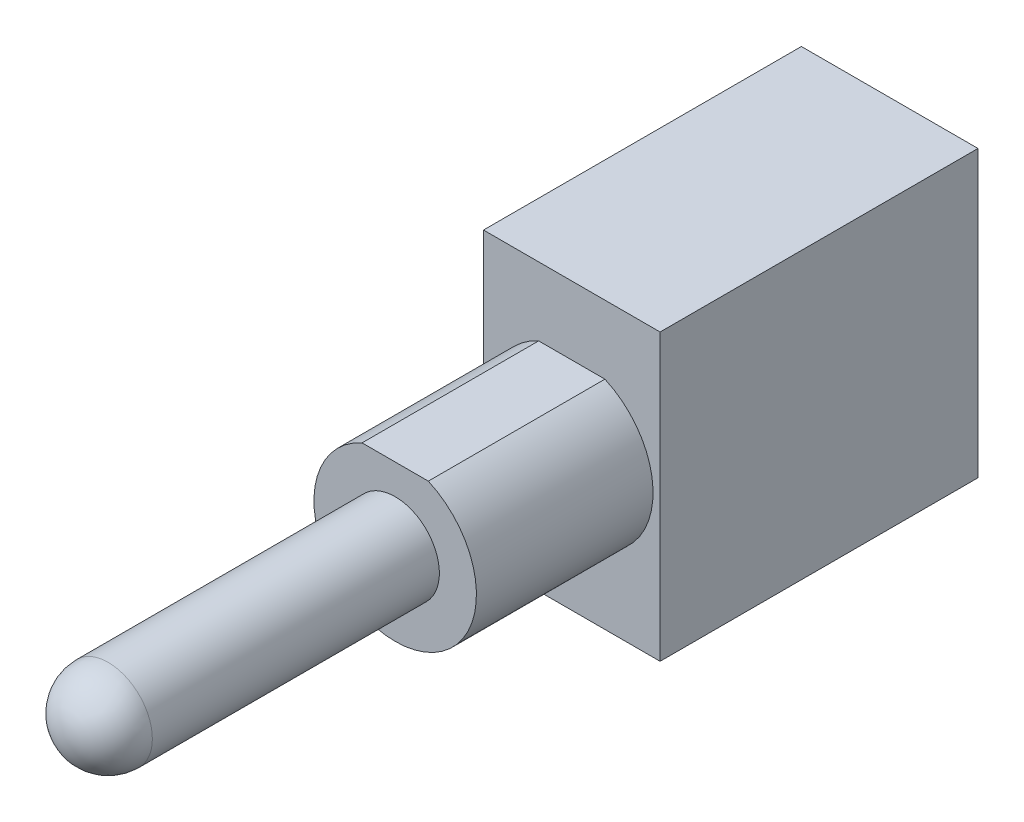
ISO-10303-21;
HEADER;
FILE_DESCRIPTION(('STEP AP214'),'2;1');
FILE_NAME('part.step','',(''),(''),'','','');
FILE_SCHEMA(('AUTOMOTIVE_DESIGN { 1 0 10303 214 1 1 1 1 }'));
ENDSEC;
DATA;
#1=APPLICATION_CONTEXT('core data for automotive mechanical design processes');
#2=APPLICATION_PROTOCOL_DEFINITION('international standard','automotive_design',2000,#1);
#3=PRODUCT_CONTEXT('',#1,'mechanical');
#4=PRODUCT('Part','Part','',(#3));
#5=PRODUCT_RELATED_PRODUCT_CATEGORY('part','',(#4));
#6=PRODUCT_DEFINITION_FORMATION('','',#4);
#7=PRODUCT_DEFINITION_CONTEXT('part definition',#1,'design');
#8=PRODUCT_DEFINITION('design','',#6,#7);
#9=PRODUCT_DEFINITION_SHAPE('','',#8);
#10=(LENGTH_UNIT() NAMED_UNIT(*) SI_UNIT(.MILLI.,.METRE.));
#11=(NAMED_UNIT(*) PLANE_ANGLE_UNIT() SI_UNIT($,.RADIAN.));
#12=(NAMED_UNIT(*) SI_UNIT($,.STERADIAN.) SOLID_ANGLE_UNIT());
#13=UNCERTAINTY_MEASURE_WITH_UNIT(LENGTH_MEASURE(1.E-05),#10,'distance_accuracy_value','');
#14=(GEOMETRIC_REPRESENTATION_CONTEXT(3) GLOBAL_UNCERTAINTY_ASSIGNED_CONTEXT((#13)) GLOBAL_UNIT_ASSIGNED_CONTEXT((#10,
#11,#12)) REPRESENTATION_CONTEXT('',''));
#15=CARTESIAN_POINT('',(0.,0.,0.));
#16=DIRECTION('',(0.,0.,1.));
#17=DIRECTION('',(1.,0.,0.));
#18=AXIS2_PLACEMENT_3D('',#15,#16,#17);
#19=CARTESIAN_POINT('',(5.08,4.1021,4.572));
#20=DIRECTION('',(0.,0.,-1.));
#21=DIRECTION('',(0.,1.,0.));
#22=AXIS2_PLACEMENT_3D('',#19,#20,#21);
#23=PLANE('',#22);
#24=DIRECTION('',(1.,0.,0.));
#25=VECTOR('',#24,1.);
#26=CARTESIAN_POINT('',(1.58690751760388,2.1336,4.572));
#27=LINE('',#26,#25);
#28=CARTESIAN_POINT('',(1.58690751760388,2.1336,4.572));
#29=VERTEX_POINT('',#28);
#30=CARTESIAN_POINT('',(3.49309248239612,2.1336,4.572));
#31=VERTEX_POINT('',#30);
#32=EDGE_CURVE('E94',#29,#31,#27,.T.);
#33=ORIENTED_EDGE('',*,*,#32,.T.);
#34=CARTESIAN_POINT('',(2.54,0.,4.572));
#35=DIRECTION('',(0.,0.,-1.));
#36=DIRECTION('',(0.,1.,0.));
#37=AXIS2_PLACEMENT_3D('',#34,#35,#36);
#38=CIRCLE('',#37,2.3368);
#39=EDGE_CURVE('E38',#29,#31,#38,.F.);
#40=ORIENTED_EDGE('',*,*,#39,.F.);
#41=EDGE_LOOP('',(#33,#40));
#42=FACE_BOUND('',#41,.T.);
#43=DIRECTION('',(0.,-1.,0.));
#44=VECTOR('',#43,1.);
#45=CARTESIAN_POINT('',(0.,4.1021,4.572));
#46=LINE('',#45,#44);
#47=CARTESIAN_POINT('',(0.,4.1021,4.572));
#48=VERTEX_POINT('',#47);
#49=CARTESIAN_POINT('',(0.,-4.1021,4.572));
#50=VERTEX_POINT('',#49);
#51=EDGE_CURVE('E122',#48,#50,#46,.T.);
#52=ORIENTED_EDGE('',*,*,#51,.T.);
#53=DIRECTION('',(-1.,0.,0.));
#54=VECTOR('',#53,1.);
#55=CARTESIAN_POINT('',(5.08,-4.1021,4.572));
#56=LINE('',#55,#54);
#57=CARTESIAN_POINT('',(5.08,-4.1021,4.572));
#58=VERTEX_POINT('',#57);
#59=EDGE_CURVE('E106',#58,#50,#56,.T.);
#60=ORIENTED_EDGE('',*,*,#59,.F.);
#61=DIRECTION('',(0.,-1.,0.));
#62=VECTOR('',#61,1.);
#63=CARTESIAN_POINT('',(5.08,4.1021,4.572));
#64=LINE('',#63,#62);
#65=CARTESIAN_POINT('',(5.08,4.1021,4.572));
#66=VERTEX_POINT('',#65);
#67=EDGE_CURVE('E117',#66,#58,#64,.T.);
#68=ORIENTED_EDGE('',*,*,#67,.F.);
#69=DIRECTION('',(-1.,0.,0.));
#70=VECTOR('',#69,1.);
#71=CARTESIAN_POINT('',(5.08,4.1021,4.572));
#72=LINE('',#71,#70);
#73=EDGE_CURVE('E114',#66,#48,#72,.T.);
#74=ORIENTED_EDGE('',*,*,#73,.T.);
#75=EDGE_LOOP('',(#52,#60,#68,#74));
#76=FACE_BOUND('',#75,.T.);
#77=ADVANCED_FACE('F30',(#42,#76),#23,.F.);
#78=CARTESIAN_POINT('',(5.08,-4.1021,4.572));
#79=DIRECTION('',(0.,1.,0.));
#80=DIRECTION('',(0.,0.,1.));
#81=AXIS2_PLACEMENT_3D('',#78,#79,#80);
#82=PLANE('',#81);
#83=DIRECTION('',(0.,0.,-1.));
#84=VECTOR('',#83,1.);
#85=CARTESIAN_POINT('',(0.,-4.1021,4.572));
#86=LINE('',#85,#84);
#87=CARTESIAN_POINT('',(0.,-4.1021,-4.572));
#88=VERTEX_POINT('',#87);
#89=EDGE_CURVE('E120',#50,#88,#86,.T.);
#90=ORIENTED_EDGE('',*,*,#89,.T.);
#91=DIRECTION('',(-1.,0.,0.));
#92=VECTOR('',#91,1.);
#93=CARTESIAN_POINT('',(5.08,-4.1021,-4.572));
#94=LINE('',#93,#92);
#95=CARTESIAN_POINT('',(5.08,-4.1021,-4.572));
#96=VERTEX_POINT('',#95);
#97=EDGE_CURVE('E107',#96,#88,#94,.T.);
#98=ORIENTED_EDGE('',*,*,#97,.F.);
#99=DIRECTION('',(0.,0.,-1.));
#100=VECTOR('',#99,1.);
#101=CARTESIAN_POINT('',(5.08,-4.1021,4.572));
#102=LINE('',#101,#100);
#103=EDGE_CURVE('E83',#58,#96,#102,.T.);
#104=ORIENTED_EDGE('',*,*,#103,.F.);
#105=ORIENTED_EDGE('',*,*,#59,.T.);
#106=EDGE_LOOP('',(#90,#98,#104,#105));
#107=FACE_BOUND('',#106,.T.);
#108=ADVANCED_FACE('F153',(#107),#82,.F.);
#109=CARTESIAN_POINT('',(5.08,4.1021,-4.572));
#110=DIRECTION('',(0.,0.,1.));
#111=DIRECTION('',(0.,-1.,0.));
#112=AXIS2_PLACEMENT_3D('',#109,#110,#111);
#113=PLANE('',#112);
#114=DIRECTION('',(0.,1.,0.));
#115=VECTOR('',#114,1.);
#116=CARTESIAN_POINT('',(0.,4.1021,-4.572));
#117=LINE('',#116,#115);
#118=CARTESIAN_POINT('',(0.,4.1021,-4.572));
#119=VERTEX_POINT('',#118);
#120=EDGE_CURVE('E118',#88,#119,#117,.T.);
#121=ORIENTED_EDGE('',*,*,#120,.T.);
#122=DIRECTION('',(-1.,0.,0.));
#123=VECTOR('',#122,1.);
#124=CARTESIAN_POINT('',(5.08,4.1021,-4.572));
#125=LINE('',#124,#123);
#126=CARTESIAN_POINT('',(5.08,4.1021,-4.572));
#127=VERTEX_POINT('',#126);
#128=EDGE_CURVE('E112',#127,#119,#125,.T.);
#129=ORIENTED_EDGE('',*,*,#128,.F.);
#130=DIRECTION('',(0.,1.,0.));
#131=VECTOR('',#130,1.);
#132=CARTESIAN_POINT('',(5.08,4.1021,-4.572));
#133=LINE('',#132,#131);
#134=EDGE_CURVE('E127',#96,#127,#133,.T.);
#135=ORIENTED_EDGE('',*,*,#134,.F.);
#136=ORIENTED_EDGE('',*,*,#97,.T.);
#137=EDGE_LOOP('',(#121,#129,#135,#136));
#138=FACE_BOUND('',#137,.T.);
#139=ADVANCED_FACE('F157',(#138),#113,.F.);
#140=CARTESIAN_POINT('',(5.08,4.1021,4.572));
#141=DIRECTION('',(0.,-1.,0.));
#142=DIRECTION('',(0.,0.,-1.));
#143=AXIS2_PLACEMENT_3D('',#140,#141,#142);
#144=PLANE('',#143);
#145=DIRECTION('',(0.,0.,1.));
#146=VECTOR('',#145,1.);
#147=CARTESIAN_POINT('',(0.,4.1021,4.572));
#148=LINE('',#147,#146);
#149=EDGE_CURVE('E75',#119,#48,#148,.T.);
#150=ORIENTED_EDGE('',*,*,#149,.T.);
#151=ORIENTED_EDGE('',*,*,#73,.F.);
#152=DIRECTION('',(0.,0.,1.));
#153=VECTOR('',#152,1.);
#154=CARTESIAN_POINT('',(5.08,4.1021,4.572));
#155=LINE('',#154,#153);
#156=EDGE_CURVE('E54',#127,#66,#155,.T.);
#157=ORIENTED_EDGE('',*,*,#156,.F.);
#158=ORIENTED_EDGE('',*,*,#128,.T.);
#159=EDGE_LOOP('',(#150,#151,#157,#158));
#160=FACE_BOUND('',#159,.T.);
#161=ADVANCED_FACE('F162',(#160),#144,.F.);
#162=CARTESIAN_POINT('',(5.08,0.,0.));
#163=DIRECTION('',(1.,0.,0.));
#164=DIRECTION('',(0.,0.,-1.));
#165=AXIS2_PLACEMENT_3D('',#162,#163,#164);
#166=PLANE('',#165);
#167=ORIENTED_EDGE('',*,*,#67,.T.);
#168=ORIENTED_EDGE('',*,*,#103,.T.);
#169=ORIENTED_EDGE('',*,*,#134,.T.);
#170=ORIENTED_EDGE('',*,*,#156,.T.);
#171=EDGE_LOOP('',(#167,#168,#169,#170));
#172=FACE_BOUND('',#171,.T.);
#173=ADVANCED_FACE('F166',(#172),#166,.T.);
#174=CARTESIAN_POINT('',(0.,0.,0.));
#175=DIRECTION('',(1.,0.,0.));
#176=DIRECTION('',(0.,0.,-1.));
#177=AXIS2_PLACEMENT_3D('',#174,#175,#176);
#178=PLANE('',#177);
#179=ORIENTED_EDGE('',*,*,#51,.F.);
#180=ORIENTED_EDGE('',*,*,#149,.F.);
#181=ORIENTED_EDGE('',*,*,#120,.F.);
#182=ORIENTED_EDGE('',*,*,#89,.F.);
#183=EDGE_LOOP('',(#179,#180,#181,#182));
#184=FACE_BOUND('',#183,.T.);
#185=ADVANCED_FACE('F150',(#184),#178,.F.);
#186=CARTESIAN_POINT('',(2.54,0.,9.652));
#187=DIRECTION('',(0.,0.,-1.));
#188=DIRECTION('',(-1.,0.,0.));
#189=AXIS2_PLACEMENT_3D('',#186,#187,#188);
#190=CYLINDRICAL_SURFACE('',#189,2.3368);
#191=ORIENTED_EDGE('',*,*,#39,.T.);
#192=DIRECTION('',(0.,0.,1.));
#193=VECTOR('',#192,1.);
#194=CARTESIAN_POINT('',(3.49309248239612,2.1336,2.57671330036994));
#195=LINE('',#194,#193);
#196=CARTESIAN_POINT('',(3.49309248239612,2.1336,9.652));
#197=VERTEX_POINT('',#196);
#198=EDGE_CURVE('E91',#31,#197,#195,.T.);
#199=ORIENTED_EDGE('',*,*,#198,.T.);
#200=CARTESIAN_POINT('',(2.54,0.,9.652));
#201=DIRECTION('',(0.,0.,1.));
#202=DIRECTION('',(1.,0.,0.));
#203=AXIS2_PLACEMENT_3D('',#200,#201,#202);
#204=CIRCLE('',#203,2.3368);
#205=CARTESIAN_POINT('',(1.58690751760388,2.1336,9.652));
#206=VERTEX_POINT('',#205);
#207=EDGE_CURVE('E125',#206,#197,#204,.T.);
#208=ORIENTED_EDGE('',*,*,#207,.F.);
#209=DIRECTION('',(0.,0.,1.));
#210=VECTOR('',#209,1.);
#211=CARTESIAN_POINT('',(1.58690751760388,2.1336,2.57671330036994));
#212=LINE('',#211,#210);
#213=EDGE_CURVE('E45',#29,#206,#212,.T.);
#214=ORIENTED_EDGE('',*,*,#213,.F.);
#215=EDGE_LOOP('',(#191,#199,#208,#214));
#216=FACE_BOUND('',#215,.T.);
#217=ADVANCED_FACE('F105',(#216),#190,.T.);
#218=CARTESIAN_POINT('',(2.54,0.,9.652));
#219=DIRECTION('',(0.,0.,1.));
#220=DIRECTION('',(1.,0.,0.));
#221=AXIS2_PLACEMENT_3D('',#218,#219,#220);
#222=PLANE('',#221);
#223=DIRECTION('',(1.,0.,0.));
#224=VECTOR('',#223,1.);
#225=CARTESIAN_POINT('',(1.58690751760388,2.1336,9.652));
#226=LINE('',#225,#224);
#227=EDGE_CURVE('E95',#206,#197,#226,.T.);
#228=ORIENTED_EDGE('',*,*,#227,.F.);
#229=ORIENTED_EDGE('',*,*,#207,.T.);
#230=EDGE_LOOP('',(#228,#229));
#231=FACE_BOUND('',#230,.T.);
#232=CARTESIAN_POINT('',(2.54,0.,9.652));
#233=DIRECTION('',(0.,0.,1.));
#234=DIRECTION('',(1.,0.,0.));
#235=AXIS2_PLACEMENT_3D('',#232,#233,#234);
#236=CIRCLE('',#235,1.27);
#237=CARTESIAN_POINT('',(1.27,0.,9.652));
#238=VERTEX_POINT('',#237);
#239=EDGE_CURVE('E132',#238,#238,#236,.T.);
#240=ORIENTED_EDGE('',*,*,#239,.F.);
#241=EDGE_LOOP('',(#240));
#242=FACE_BOUND('',#241,.T.);
#243=ADVANCED_FACE('F140',(#231,#242),#222,.T.);
#244=CARTESIAN_POINT('',(2.54,0.,19.177));
#245=DIRECTION('',(0.,0.,-1.));
#246=DIRECTION('',(-1.,0.,0.));
#247=AXIS2_PLACEMENT_3D('',#244,#245,#246);
#248=CYLINDRICAL_SURFACE('',#247,1.27);
#249=CARTESIAN_POINT('',(2.54,0.,17.907));
#250=DIRECTION('',(0.,0.,-1.));
#251=DIRECTION('',(-1.,0.,0.));
#252=AXIS2_PLACEMENT_3D('',#249,#250,#251);
#253=CIRCLE('',#252,1.27);
#254=CARTESIAN_POINT('',(1.27,0.,17.907));
#255=VERTEX_POINT('',#254);
#256=EDGE_CURVE('E11',#255,#255,#253,.T.);
#257=CARTESIAN_POINT('',(1.27,0.,17.907));
#258=CARTESIAN_POINT('',(1.27,0.,17.8210104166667));
#259=CARTESIAN_POINT('',(1.27,0.,17.7350208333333));
#260=CARTESIAN_POINT('',(1.27,0.,17.5630416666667));
#261=CARTESIAN_POINT('',(1.27,0.,17.4770520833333));
#262=CARTESIAN_POINT('',(1.27,0.,17.3050729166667));
#263=CARTESIAN_POINT('',(1.27,0.,17.2190833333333));
#264=CARTESIAN_POINT('',(1.27,0.,17.0471041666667));
#265=CARTESIAN_POINT('',(1.27,0.,16.9611145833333));
#266=CARTESIAN_POINT('',(1.27,0.,16.7891354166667));
#267=CARTESIAN_POINT('',(1.27,0.,16.7031458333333));
#268=CARTESIAN_POINT('',(1.27,0.,16.5311666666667));
#269=CARTESIAN_POINT('',(1.27,0.,16.4451770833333));
#270=CARTESIAN_POINT('',(1.27,0.,16.2731979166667));
#271=CARTESIAN_POINT('',(1.27,0.,16.1872083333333));
#272=CARTESIAN_POINT('',(1.27,0.,16.0152291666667));
#273=CARTESIAN_POINT('',(1.27,0.,15.9292395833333));
#274=CARTESIAN_POINT('',(1.27,0.,15.7572604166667));
#275=CARTESIAN_POINT('',(1.27,0.,15.6712708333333));
#276=CARTESIAN_POINT('',(1.27,0.,15.4992916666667));
#277=CARTESIAN_POINT('',(1.27,0.,15.4133020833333));
#278=CARTESIAN_POINT('',(1.27,0.,15.2413229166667));
#279=CARTESIAN_POINT('',(1.27,0.,15.1553333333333));
#280=CARTESIAN_POINT('',(1.27,0.,14.9833541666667));
#281=CARTESIAN_POINT('',(1.27,0.,14.8973645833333));
#282=CARTESIAN_POINT('',(1.27,0.,14.7253854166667));
#283=CARTESIAN_POINT('',(1.27,0.,14.6393958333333));
#284=CARTESIAN_POINT('',(1.27,0.,14.4674166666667));
#285=CARTESIAN_POINT('',(1.27,0.,14.3814270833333));
#286=CARTESIAN_POINT('',(1.27,0.,14.2094479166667));
#287=CARTESIAN_POINT('',(1.27,0.,14.1234583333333));
#288=CARTESIAN_POINT('',(1.27,0.,13.9514791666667));
#289=CARTESIAN_POINT('',(1.27,0.,13.8654895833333));
#290=CARTESIAN_POINT('',(1.27,0.,13.6935104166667));
#291=CARTESIAN_POINT('',(1.27,0.,13.6075208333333));
#292=CARTESIAN_POINT('',(1.27,0.,13.4355416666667));
#293=CARTESIAN_POINT('',(1.27,0.,13.3495520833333));
#294=CARTESIAN_POINT('',(1.27,0.,13.1775729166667));
#295=CARTESIAN_POINT('',(1.27,0.,13.0915833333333));
#296=CARTESIAN_POINT('',(1.27,0.,12.9196041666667));
#297=CARTESIAN_POINT('',(1.27,0.,12.8336145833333));
#298=CARTESIAN_POINT('',(1.27,0.,12.6616354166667));
#299=CARTESIAN_POINT('',(1.27,0.,12.5756458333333));
#300=CARTESIAN_POINT('',(1.27,0.,12.4036666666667));
#301=CARTESIAN_POINT('',(1.27,0.,12.3176770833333));
#302=CARTESIAN_POINT('',(1.27,0.,12.1456979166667));
#303=CARTESIAN_POINT('',(1.27,0.,12.0597083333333));
#304=CARTESIAN_POINT('',(1.27,0.,11.8877291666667));
#305=CARTESIAN_POINT('',(1.27,0.,11.8017395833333));
#306=CARTESIAN_POINT('',(1.27,0.,11.6297604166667));
#307=CARTESIAN_POINT('',(1.27,0.,11.5437708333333));
#308=CARTESIAN_POINT('',(1.27,0.,11.3717916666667));
#309=CARTESIAN_POINT('',(1.27,0.,11.2858020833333));
#310=CARTESIAN_POINT('',(1.27,0.,11.1138229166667));
#311=CARTESIAN_POINT('',(1.27,0.,11.0278333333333));
#312=CARTESIAN_POINT('',(1.27,0.,10.8558541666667));
#313=CARTESIAN_POINT('',(1.27,0.,10.7698645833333));
#314=CARTESIAN_POINT('',(1.27,0.,10.5978854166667));
#315=CARTESIAN_POINT('',(1.27,0.,10.5118958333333));
#316=CARTESIAN_POINT('',(1.27,0.,10.3399166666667));
#317=CARTESIAN_POINT('',(1.27,0.,10.2539270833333));
#318=CARTESIAN_POINT('',(1.27,0.,10.0819479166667));
#319=CARTESIAN_POINT('',(1.27,0.,9.99595833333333));
#320=CARTESIAN_POINT('',(1.27,0.,9.82397916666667));
#321=CARTESIAN_POINT('',(1.27,0.,9.73798958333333));
#322=CARTESIAN_POINT('',(1.27,0.,9.652));
#323=B_SPLINE_CURVE_WITH_KNOTS('',3,(#257,#258,#259,#260,#261,#262,#263,#264,#265,#266,#267,
#268,#269,#270,#271,#272,#273,#274,#275,#276,#277,#278,#279,#280,#281,#282,#283,#284,#285,#286,
#287,#288,#289,#290,#291,#292,#293,#294,#295,#296,#297,#298,#299,#300,#301,#302,#303,#304,#305,
#306,#307,#308,#309,#310,#311,#312,#313,#314,#315,#316,#317,#318,#319,#320,#321,#322),
.UNSPECIFIED.,.F.,.F.,(4,2,2,2,2,2,2,2,2,2,2,2,2,2,2,2,2,2,2,2,2,2,2,2,2,2,2,2,2,2,2,2,4),(0.,
0.25796875,0.515937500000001,0.773906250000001,1.031875,1.28984375,1.5478125,1.80578125,2.06375,
2.32171875,2.5796875,2.83765625,3.095625,3.35359375,3.6115625,3.86953125,4.1275,4.38546875,
4.6434375,4.90140625,5.159375,5.41734375,5.6753125,5.93328125,6.19125,6.44921875,6.7071875,
6.96515625,7.223125,7.48109375,7.7390625,7.99703125,8.255),.UNSPECIFIED.);
#324=EDGE_CURVE('BSEAM138',#255,#238,#323,.T.);
#325=ORIENTED_EDGE('',*,*,#256,.T.);
#326=ORIENTED_EDGE('',*,*,#239,.T.);
#327=ORIENTED_EDGE('',*,*,#324,.T.);
#328=ORIENTED_EDGE('',*,*,#324,.F.);
#329=EDGE_LOOP('',(#325,#327,#326,#328));
#330=FACE_BOUND('',#329,.T.);
#331=ADVANCED_FACE('F138',(#330),#248,.T.);
#332=CARTESIAN_POINT('',(2.54,0.,17.907));
#333=DIRECTION('',(0.,0.,1.));
#334=DIRECTION('',(1.,0.,0.));
#335=AXIS2_PLACEMENT_3D('',#332,#333,#334);
#336=SPHERICAL_SURFACE('',#335,1.27);
#337=ORIENTED_EDGE('',*,*,#256,.F.);
#338=EDGE_LOOP('',(#337));
#339=FACE_BOUND('',#338,.T.);
#340=ADVANCED_FACE('F32',(#339),#336,.T.);
#341=CARTESIAN_POINT('',(1.58690751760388,2.1336,2.57671330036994));
#342=DIRECTION('',(0.,-1.,0.));
#343=DIRECTION('',(0.,0.,-1.));
#344=AXIS2_PLACEMENT_3D('',#341,#342,#343);
#345=PLANE('',#344);
#346=ORIENTED_EDGE('',*,*,#213,.T.);
#347=ORIENTED_EDGE('',*,*,#227,.T.);
#348=ORIENTED_EDGE('',*,*,#198,.F.);
#349=ORIENTED_EDGE('',*,*,#32,.F.);
#350=EDGE_LOOP('',(#346,#347,#348,#349));
#351=FACE_BOUND('',#350,.T.);
#352=ADVANCED_FACE('F93',(#351),#345,.F.);
#353=CLOSED_SHELL('',(#77,#108,#139,#161,#173,#185,#217,#243,#331,#340,#352));
#354=MANIFOLD_SOLID_BREP('B2',#353);
#355=ADVANCED_BREP_SHAPE_REPRESENTATION('',(#18,#354),#14);
#356=SHAPE_DEFINITION_REPRESENTATION(#9,#355);
ENDSEC;
END-ISO-10303-21;
